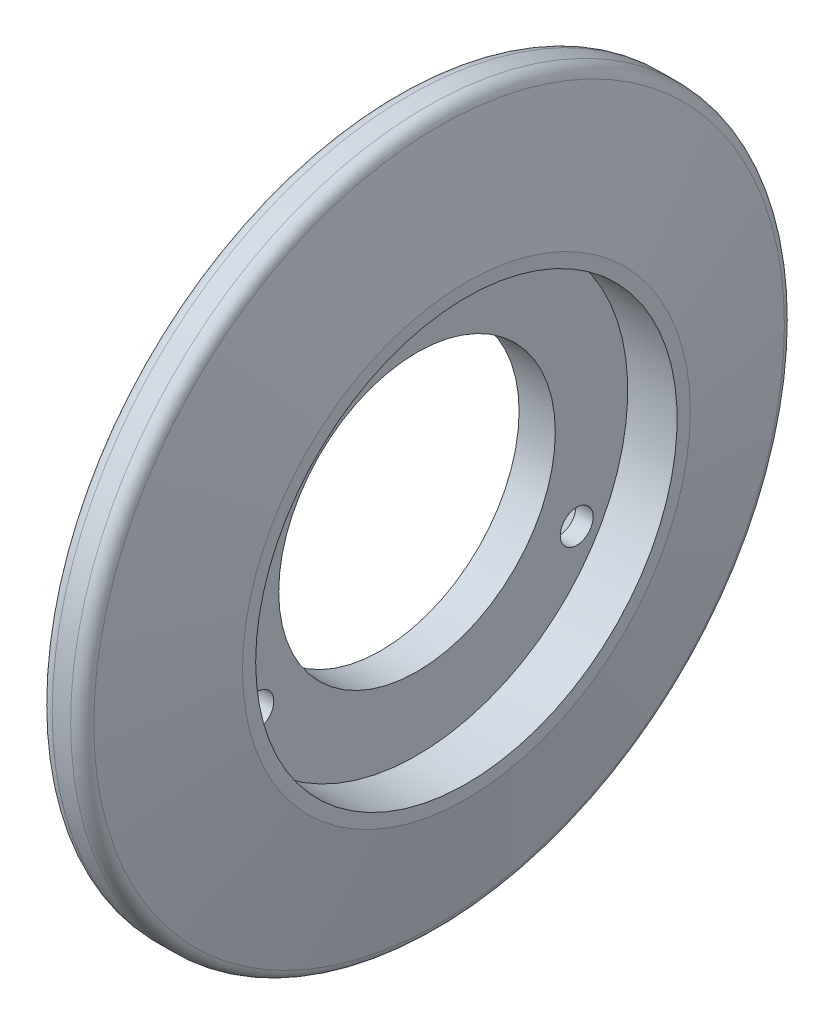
from build123d import *

# Parameters (mm, degrees)
CONG_1_R                     = 2
PER_AGE1_D                   = 5
PER_AGE1_DEPTH               = 20
PER_AGE1_CSINK_D             = 10
PER_AGE1_CSINK_ANGLE         = 82
R_P_TITION_CIRCULAIRE1_COUNT = 3


with BuildPart() as part:
    # Esquisse1 → Base-R_volution (revolve)
    with BuildSketch(Plane.XY, mode=Mode.PRIVATE) as base_r_volution_sk:
        Polygon((5.5, -34), (10, -54), (16, -54), (20.5, -34), (20.5, -32), (13, -32), (13, -21), (7.5, -21), (7.5, -33), (5.5, -33), align=None)
    revolve(base_r_volution_sk.sketch.rotate(Axis((-40, 0, 0), (1, 0, 0)), 270), axis=Axis((-40, 0, 0), (1, 0, 0)))

    # Cong_1
    cong_1_edges = [part.edges().sort_by_distance(p)[0] for p in [
        (16, 0, -54),
        (10, 0, -54),
    ]]
    fillet(cong_1_edges, radius=CONG_1_R)

    # Per_age1
    with Locations(Plane.ZY.offset(-7.5)):
        with Locations((0, 28)):
            per_age1 = CounterSinkHole(PER_AGE1_D / 2, PER_AGE1_CSINK_D / 2, depth=PER_AGE1_DEPTH, counter_sink_angle=PER_AGE1_CSINK_ANGLE)

    # R_p_tition circulaire1: Per_age1 ×3 about axis
    r_p_tition_circulaire1_axis = Axis((0, 0, 0), (1, 0, 0))
    for i in range(1, R_P_TITION_CIRCULAIRE1_COUNT):
        add(per_age1.rotate(r_p_tition_circulaire1_axis, i * 360 / R_P_TITION_CIRCULAIRE1_COUNT), mode=Mode.SUBTRACT)


solid = part.part
